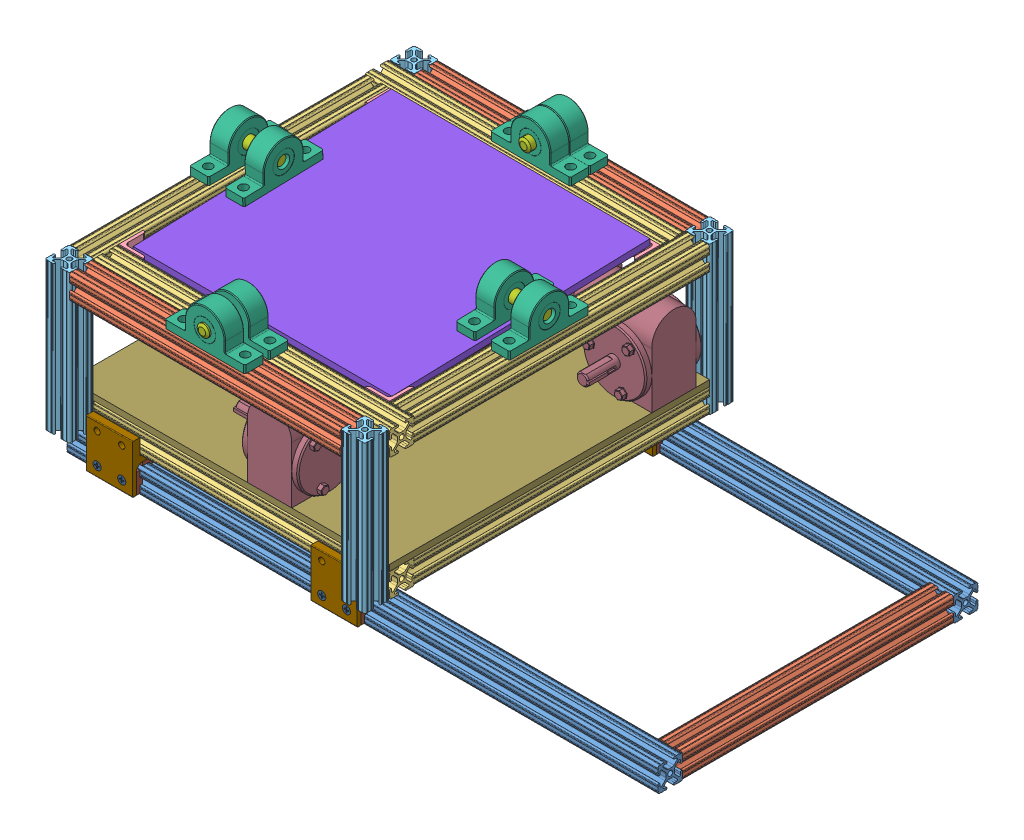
SolidWorks assembly Platform doneish.SLDASM, configuration Default (file format 9000). Lengths in mm.
Overall size (609.6 229.07 383.98).
87 component instances, 13 part files, 104 mates.
Components (placement in the parent):
- 24ftbar-1: 24ftbar.sldprt [Default] at (548.5997 314.1895 462.0163) x (0 0 -1) z (1 0 0) size (25.4 25.4 609.6)
- Beams11in-4: Beams11in.sldprt [Default] at (535.8997 314.1895 474.7163) size (25.4 25.4 279.4)
- Beams11in-5: Beams11in.sldprt [Default] at (-48.3003 314.1895 474.7163) size (25.4 25.4 279.4)
- 24ftbar-2: 24ftbar.sldprt [Default] at (548.5997 314.1895 157.2163) x (0 0 -1) z (1 0 0) size (25.4 25.4 609.6)
- Beams12in-4: Beams12in.sldprt [Default] at (271.7397 349.7495 462.1687) x (0 0 -1) z (1 0 0) size (25.4 25.4 304.8)
- Beams12in-5: Beams12in.sldprt [Default] at (259.0397 349.7495 144.6687) x (-1 0 0) z (0 0 -1) size (25.4 25.4 304.8)
- Beams12in-6: Beams12in.sldprt [Default] at (-45.7603 349.7495 170.0687) x (-1 0 0) z (0 0 -1) size (25.4 25.4 304.8)
- Beams12in-7: Beams12in.sldprt [Default] at (246.3397 349.7495 157.3687) x (0 0 -1) z (1 0 0) size (25.4 25.4 304.8)
- Corner bracket-1: Corner bracket.sldprt [Default] at (246.3397 349.7495 449.4687) x (0 -1 0) z (0 0 -1) size (25.4 25.4 25.4)
- Corner bracket-2: Corner bracket.sldprt [Default] at (-33.0603 349.7495 170.0687) x (0 1 0) z (1 0 0) size (25.4 25.4 25.4)
- Corner bracket-3: Corner bracket.sldprt [Default] at (246.3397 349.7495 170.0687) x (0 1 0) z (0 0 1) size (25.4 25.4 25.4)
- Corner bracket-4: Corner bracket.sldprt [Default] at (-33.0603 349.7495 449.4687) x (0 -1 0) z (1 0 0) size (25.4 25.4 25.4)
- Platform2-1: Platform2.SLDASM [Default] at (271.6705 476.3917 462.1369) x (0 0 -1) z (0.999998 -0.002168 0) size (330.2 25.4 330.2)
  - Beams12in-7: Beams12in.sldprt [Default] at origin size (25.4 25.4 304.8)
  - Beams12in-5: Beams12in.sldprt [Default] at (317.5 0 -12.7) x (0 0 -1) z (1 0 0) size (25.4 25.4 304.8)
  - Beams12in-6: Beams12in.sldprt [Default] at (292.1 0 -317.5) x (0 0 -1) z (1 0 0) size (25.4 25.4 304.8)
  - Beams12in-8: Beams12in.sldprt [Default] at (304.8 0 -25.4) size (25.4 25.4 304.8)
  - Corner bracket-1: Corner bracket.sldprt [Default] at (12.7 0 -25.4) x (0 -1 0) z (1 0 0) size (25.4 25.4 25.4)
  - Corner bracket-2: Corner bracket.sldprt [Default] at (292.1 0 -304.8) x (0 1 0) z (0 0 1) size (25.4 25.4 25.4)
  - Corner bracket-3: Corner bracket.sldprt [Default] at (292.1 0 -25.4) x (0 1 0) z (-1 0 0) size (25.4 25.4 25.4)
  - Corner bracket-4: Corner bracket.sldprt [Default] at (12.7 0 -304.8) x (0 -1 0) z (0 0 1) size (25.4 25.4 25.4)
- Beams6in-1: Beams6in.sldprt [Default] at (259.0397 184.6495 131.9687) x (0 0 -1) z (0 -1 0) size (25.4 25.4 152.4)
- Beams6in-2: Beams6in.sldprt [Default] at (259.0397 184.6495 487.5687) x (0 0 -1) z (0 -1 0) size (25.4 25.4 152.4)
- Sleeve bearing 05diameter-1: Sleeve bearing 05diameter.SLDPRT [2820T6] at (106.6397 508.4995 154.5588) x (-0.999998 0.002168 0) z (0 0 -1) size (82.55 39.69 19.84)
- Sleeve bearing 05diameter-2: Sleeve bearing 05diameter.SLDPRT [2820T6] at (106.6397 508.4995 464.915) x (0.999998 -0.002168 0) z (0 0 1) size (82.55 39.69 19.84)
- Beams6in-3: Beams6in.sldprt [Default] at (-45.7603 184.6495 131.9687) x (0 0 -1) z (0 -1 0) size (25.4 25.4 152.4)
- Beams6in-4: Beams6in.sldprt [Default] at (-45.7603 184.6495 487.5687) x (0 0 -1) z (0 -1 0) size (25.4 25.4 152.4)
- Beams11in-6: Beams11in.sldprt [Default] at (271.7397 476.7495 487.5687) x (0 0 -1) z (1 0 0) size (25.4 25.4 279.4)
- Beams11in-7: Beams11in.sldprt [Default] at (271.7397 476.7495 131.9687) x (0 0 -1) z (1 0 0) size (25.4 25.4 279.4)
- Sleeve bearing 05diameter-3: Sleeve bearing 05diameter.SLDPRT [2820T6] at (106.6397 508.4995 490.3468) x (-1 0 0) z (0 0 -1) size (82.55 39.69 19.84)
- Sleeve bearing 05diameter-4: Sleeve bearing 05diameter.SLDPRT [2820T6] at (106.6397 508.4995 134.7468) x (-1 0 0) z (0 0 -1) size (82.55 39.69 19.84)
- Rod-1: Rod.SLDPRT [Default] at (106.6397 508.4995 503.2532) x (0.451188 0.892429 0) z (0 0 -1) size (12.7 12.7 50.8)
- Rod-2: Rod.SLDPRT [Default] at (106.6397 508.4995 171.5164) x (-0.988826 0.149076 0) z (0 0 -1) size (12.7 12.7 50.8)
- Sleeve bearing 05diameter-5: Sleeve bearing 05diameter.SLDPRT [2820T6] at (261.8174 508.1631 309.7687) x (0 0 -1) z (0.999998 -0.002168 0) size (82.55 39.69 19.84)
- Sleeve bearing 05diameter-6: Sleeve bearing 05diameter.SLDPRT [2820T6] at (-48.5381 508.8359 309.7687) x (0 0 -1) z (0.999998 -0.002168 0) size (82.55 39.69 19.84)
- Sleeve bearing 05diameter-7: Sleeve bearing 05diameter.SLDPRT [2820T6] at (225.7813 508.2412 309.7687) x (0.000061 0.02798 -0.999608) z (0.999998 -0.002168 0) size (82.55 39.69 19.84)
- Sleeve bearing 05diameter-8: Sleeve bearing 05diameter.SLDPRT [2820T6] at (-12.5019 508.7577 309.7687) x (0.000061 0.02798 -0.999608) z (0.999998 -0.002168 0) size (82.55 39.69 19.84)
- Rod-3: Rod.SLDPRT [Default] at (218.3994 508.2572 309.7687) x (0.000846 0.390503 -0.920601) z (0.999998 -0.002168 0) size (12.7 12.7 50.8)
- Rod-4: Rod.SLDPRT [Default] at (-55.9199 508.8519 309.7687) x (-0.000416 -0.191908 -0.981413) z (0.999998 -0.002168 0) size (12.7 12.7 50.8)
- Plate-1: Plate.SLDPRT [Default] at (105.9719 483.1769 306.6951) x (-0.000727 0.027982 -0.999608) z (0.999997 -0.002146 -0.000787) size (266.7 6.35 266.7)
- Linearbearing-1: Linearbearing.sldasm [Default] at (222.5272 314.0371 462.1687) x (0 0 -1) z (1 0 0) size (41.25 49.99 47.63)
  - _6715_p_2-1: _6715_p_2.sldprt [Default] at origin size (41.25 49.99 47.63)
  - _3625__4-1: _3625__4.sldprt [Default] at (-18.973 0 12.6873) x (0 0 -1) z (0 -1 0) size (8.43 1.79 8.43)
  - _3625__4-2: _3625__4.sldprt [Default] at (-18.973 0 -12.7127) x (0 0 -1) z (0 -1 0) size (8.43 1.79 8.43)
  - _3625__4-3: _3625__4.sldprt [Default] at (18.973 0 12.6873) x (0 0 -1) z (0 1 0) size (8.43 1.79 8.43)
  - _3625__4-4: _3625__4.sldprt [Default] at (18.973 0 -12.7127) x (0 0 -1) z (0 1 0) size (8.43 1.79 8.43)
  - _3625__4-5: _3625__4.sldprt [Default] at (0 19.5826 12.6873) x (1 0 0) z (0 0 -1) size (8.43 1.79 8.43)
  - _3625__4-6: _3625__4.sldprt [Default] at (0 19.5826 -12.7127) x (1 0 0) z (0 0 -1) size (8.43 1.79 8.43)
  - _6790_11-1: _6790_11.sldprt [Default] at (-12.8524 0 -0.0254) x (0 0 -1) z (1 0 0) size (47.37 20.62 6.35)
  - _6790_11-2: _6790_11.sldprt [Default] at (12.8524 0 -0.0254) x (0 0 -1) z (-1 0 0) size (47.37 20.62 6.35)
  - _6790_11-3: _6790_11.sldprt [Default] at (0 12.8524 -0.0254) x (0 0 -1) z (0 -1 0) size (47.37 20.62 6.35)
- Linearbearing-2: Linearbearing.sldasm [Default] at (-9.2478 314.0371 462.1687) x (0 0 -1) z (1 0 0) size (41.25 49.99 47.63)
  - _6715_p_2-1: _6715_p_2.sldprt [Default] at origin size (41.25 49.99 47.63)
  - _3625__4-1: _3625__4.sldprt [Default] at (-18.973 0 12.6873) x (0 0 -1) z (0 -1 0) size (8.43 1.79 8.43)
  - _3625__4-2: _3625__4.sldprt [Default] at (-18.973 0 -12.7127) x (0 0 -1) z (0 -1 0) size (8.43 1.79 8.43)
  - _3625__4-3: _3625__4.sldprt [Default] at (18.973 0 12.6873) x (0 0 -1) z (0 1 0) size (8.43 1.79 8.43)
  - _3625__4-4: _3625__4.sldprt [Default] at (18.973 0 -12.7127) x (0 0 -1) z (0 1 0) size (8.43 1.79 8.43)
  - _3625__4-5: _3625__4.sldprt [Default] at (0 19.5826 12.6873) x (1 0 0) z (0 0 -1) size (8.43 1.79 8.43)
  - _3625__4-6: _3625__4.sldprt [Default] at (0 19.5826 -12.7127) x (1 0 0) z (0 0 -1) size (8.43 1.79 8.43)
  - _6790_11-1: _6790_11.sldprt [Default] at (-12.8524 0 -0.0254) x (0 0 -1) z (1 0 0) size (47.37 20.62 6.35)
  - _6790_11-2: _6790_11.sldprt [Default] at (12.8524 0 -0.0254) x (0 0 -1) z (-1 0 0) size (47.37 20.62 6.35)
  - _6790_11-3: _6790_11.sldprt [Default] at (0 12.8524 -0.0254) x (0 0 -1) z (0 -1 0) size (47.37 20.62 6.35)
- Linearbearing-3: Linearbearing.sldasm [Default] at (-9.2478 314.0371 157.3687) x (0 0 1) z (-1 0 0) size (41.25 49.99 47.63)
  - _6715_p_2-1: _6715_p_2.sldprt [Default] at origin size (41.25 49.99 47.63)
  - _3625__4-1: _3625__4.sldprt [Default] at (-18.973 0 12.6873) x (0 0 -1) z (0 -1 0) size (8.43 1.79 8.43)
  - _3625__4-2: _3625__4.sldprt [Default] at (-18.973 0 -12.7127) x (0 0 -1) z (0 -1 0) size (8.43 1.79 8.43)
  - _3625__4-3: _3625__4.sldprt [Default] at (18.973 0 12.6873) x (0 0 -1) z (0 1 0) size (8.43 1.79 8.43)
  - _3625__4-4: _3625__4.sldprt [Default] at (18.973 0 -12.7127) x (0 0 -1) z (0 1 0) size (8.43 1.79 8.43)
  - _3625__4-5: _3625__4.sldprt [Default] at (0 19.5826 12.6873) x (1 0 0) z (0 0 -1) size (8.43 1.79 8.43)
  - _3625__4-6: _3625__4.sldprt [Default] at (0 19.5826 -12.7127) x (1 0 0) z (0 0 -1) size (8.43 1.79 8.43)
  - _6790_11-1: _6790_11.sldprt [Default] at (-12.8524 0 -0.0254) x (0 0 -1) z (1 0 0) size (47.37 20.62 6.35)
  - _6790_11-2: _6790_11.sldprt [Default] at (12.8524 0 -0.0254) x (0 0 -1) z (-1 0 0) size (47.37 20.62 6.35)
  - _6790_11-3: _6790_11.sldprt [Default] at (0 12.8524 -0.0254) x (0 0 -1) z (0 -1 0) size (47.37 20.62 6.35)
- Linearbearing-4: Linearbearing.sldasm [Default] at (222.5272 314.0371 157.3687) x (0 0 1) z (-1 0 0) size (41.25 49.99 47.63)
  - _6715_p_2-1: _6715_p_2.sldprt [Default] at origin size (41.25 49.99 47.63)
  - _3625__4-1: _3625__4.sldprt [Default] at (-18.973 0 12.6873) x (0 0 -1) z (0 -1 0) size (8.43 1.79 8.43)
  - _3625__4-2: _3625__4.sldprt [Default] at (-18.973 0 -12.7127) x (0 0 -1) z (0 -1 0) size (8.43 1.79 8.43)
  - _3625__4-3: _3625__4.sldprt [Default] at (18.973 0 12.6873) x (0 0 -1) z (0 1 0) size (8.43 1.79 8.43)
  - _3625__4-4: _3625__4.sldprt [Default] at (18.973 0 -12.7127) x (0 0 -1) z (0 1 0) size (8.43 1.79 8.43)
  - _3625__4-5: _3625__4.sldprt [Default] at (0 19.5826 12.6873) x (1 0 0) z (0 0 -1) size (8.43 1.79 8.43)
  - _3625__4-6: _3625__4.sldprt [Default] at (0 19.5826 -12.7127) x (1 0 0) z (0 0 -1) size (8.43 1.79 8.43)
  - _6790_11-1: _6790_11.sldprt [Default] at (-12.8524 0 -0.0254) x (0 0 -1) z (1 0 0) size (47.37 20.62 6.35)
  - _6790_11-2: _6790_11.sldprt [Default] at (12.8524 0 -0.0254) x (0 0 -1) z (-1 0 0) size (47.37 20.62 6.35)
  - _6790_11-3: _6790_11.sldprt [Default] at (0 12.8524 -0.0254) x (0 0 -1) z (0 -1 0) size (47.37 20.62 6.35)
- bottom plate-1: bottom plate.SLDPRT [Default] at (106.6397 362.4495 309.7687) size (330.2 6.35 330.2)
- 59825K310_RIGHT-ANGLE SHAFT DC GEARMOTOR-1: 59825K310_RIGHT-ANGLE SHAFT DC GEARMOTOR.SLDPRT [59825K31] at (179.5377 427.2195 181.3098) size (223.17 90.17 100.08)
- 59825K310_RIGHT-ANGLE SHAFT DC GEARMOTOR-2: 59825K310_RIGHT-ANGLE SHAFT DC GEARMOTOR.SLDPRT [59825K31] at (148.0409 427.2195 382.6667) x (0 0 1) z (-1 0 0) size (223.17 90.17 100.08)
Mates (geometry in assembly coordinates):
- Coincident1: coincident anti-aligned: plane of 24ftbar-1 through (-61.0003 320.5226 449.3163) normal (0 0 -1); plane of Beams11in-4 through (535.8997 314.1895 449.3163) normal (0 0 1)
- Coincident3: coincident aligned: plane of 24ftbar-1 through (-61.0003 326.8895 452.4659) normal (0 1 0); plane of Beams11in-5 through (-54.6334 326.8895 169.9163) normal (0 1 0)
- Coincident5: coincident aligned: plane of 24ftbar-1 through (-61.0003 304.1311 474.7163) normal (-1 0 0); plane of Beams11in-5 through (-61.0003 307.8564 169.9163) normal (-1 0 0)
- Coincident6: coincident anti-aligned: plane of Beams11in-5 through (-61.0003 304.1311 169.9163) normal (0 0 -1); plane of 24ftbar-2 through (-61.0003 323.7399 169.9163) normal (0 0 1)
- Coincident7: coincident aligned: plane of Beams11in-5 through (-54.6334 326.8895 169.9163) normal (0 1 0); plane of 24ftbar-2 through (-61.0003 326.8895 163.5494) normal (0 1 0)
- Coincident8: coincident aligned: plane of Beams11in-5 through (-61.0003 307.8564 169.9163) normal (-1 0 0); plane of 24ftbar-2 through (-61.0003 304.1311 169.9163) normal (-1 0 0)
- Coincident9: coincident anti-aligned: plane of Beams11in-4 through (523.1997 304.1311 169.9163) normal (0 0 -1); plane of 24ftbar-2 through (-61.0003 323.7399 169.9163) normal (0 0 1)
- Coincident10: coincident aligned: plane of Beams11in-4 through (548.5997 304.6391 169.9163) normal (1 0 0); plane of 24ftbar-2 through (548.5997 304.1311 169.9163) normal (1 0 0)
- Coincident12: coincident aligned: plane of Beams11in-4 through (529.5666 326.8895 169.9163) normal (0 1 0); plane of 24ftbar-2 through (-61.0003 326.8895 147.6659) normal (0 1 0)
- Coincident13: coincident anti-aligned: plane of 24ftbar-1 through (-61.0003 320.5226 449.3163) normal (0 0 -1); plane of Linearbearing-2/_6790_11-2 through (-32.9587 317.2121 449.3163) normal (0 0 1)
- Coincident16: coincident anti-aligned: plane of 24ftbar-1 through (-61.0003 326.8895 468.3494) normal (0 1 0); plane of Linearbearing-2/_6790_11-3 through (-32.9587 326.8895 465.3437) normal (0 -1 0)
- Coincident17: coincident anti-aligned: plane of 24ftbar-1 through (-61.0003 304.6391 449.3163) normal (0 0 -1); plane of Linearbearing-1/_6790_11-2 through (198.8163 303.7247 449.3163) normal (0 0 1)
- Coincident18: coincident anti-aligned: plane of 24ftbar-1 through (-61.0003 326.8895 452.4659) normal (0 1 0); plane of Linearbearing-1/_6790_11-3 through (198.8163 326.8895 451.8563) normal (0 -1 0)
- Coincident19: coincident anti-aligned: plane of 24ftbar-2 through (-61.0003 320.5226 144.5163) normal (0 0 -1); plane of Linearbearing-4/_6790_11-1 through (246.2381 324.3495 144.5163) normal (0 0 1)
- Coincident20: coincident anti-aligned: plane of Linearbearing-4/_6790_11-3 through (246.2381 326.8895 167.6811) normal (0 -1 0); plane of 24ftbar-2 through (-61.0003 326.8895 163.5494) normal (0 1 0)
- Coincident21: coincident anti-aligned: plane of 24ftbar-2 through (-61.0003 320.5226 144.5163) normal (0 0 -1); plane of Linearbearing-3/_6790_11-1 through (14.4631 324.3495 144.5163) normal (0 0 1)
- Coincident22: coincident anti-aligned: plane of 24ftbar-2 through (-61.0003 326.8895 163.5494) normal (0 1 0); plane of Linearbearing-3/_6790_11-3 through (14.4631 326.8895 167.6811) normal (0 -1 0)
- LimitDistance1: limit distance = 2.54 mm anti-aligned: plane of Linearbearing-2/_6715_p_2-1 through (-33.0603 304.4867 482.0315) normal (-1 0 0); plane of Beams11in-5 through (-35.6003 320.5226 169.9163) normal (1 0 0)
- Coincident32: coincident anti-aligned: plane of bottom plate-1 through (106.6397 368.7995 309.7687) normal (0 1 0); plane of 59825K310_RIGHT-ANGLE SHAFT DC GEARMOTOR-1 through (271.7397 368.7995 204.1444) normal (0 -1 0)
- Coincident33: coincident anti-aligned: plane of bottom plate-1 through (106.6397 368.7995 309.7687) normal (0 1 0); plane of 59825K310_RIGHT-ANGLE SHAFT DC GEARMOTOR-2 through (125.2063 368.7995 474.8687) normal (0 -1 0)
- Coincident2: coincident anti-aligned: plane of Beams12in-4 through (-33.0603 356.0826 449.4687) normal (0 0 -1); plane of Corner bracket-1 through (246.3397 337.0495 449.4687) normal (0 0 1)
- Coincident34: coincident aligned: plane of Beams12in-4 through (-33.0603 362.4495 452.6183) normal (0 1 0); plane of Corner bracket-1 through (246.3397 362.4495 427.2437) normal (0 1 0)
- Coincident35: coincident anti-aligned: plane of Beams12in-4 through (-33.0603 356.0826 449.4687) normal (0 0 -1); plane of Beams12in-5 through (271.7397 339.6911 449.4687) normal (0 0 1)
- Coincident36: coincident aligned: plane of Beams12in-4 through (271.7397 339.6911 474.8687) normal (1 0 0); plane of Beams12in-5 through (271.7397 359.2999 449.4687) normal (1 0 0)
- Coincident37: coincident anti-aligned: plane of Beams12in-4 through (-33.0603 356.0826 449.4687) normal (0 0 -1); plane of Corner bracket-4 through (-7.6603 337.0495 449.4687) normal (0 0 1)
- Coincident38: coincident aligned: plane of Beams12in-4 through (-33.0603 362.4495 452.6183) normal (0 1 0); plane of Corner bracket-4 through (-10.8353 362.4495 449.4687) normal (0 1 0)
- Coincident40: coincident aligned: plane of Beams12in-4 through (-33.0603 337.0495 471.7191) normal (0 -1 0); plane of Beams6in-2 through (259.0397 337.0495 487.5687) normal (0 -1 0)
- Coincident41: coincident anti-aligned: plane of Beams12in-4 through (-33.0603 359.2999 474.8687) normal (0 0 1); plane of Beams6in-2 through (265.3728 489.4495 474.8687) normal (0 0 -1)
- Coincident45: coincident aligned: plane of Beams12in-4 through (271.7397 339.6911 474.8687) normal (1 0 0); plane of Beams6in-2 through (271.7397 489.4495 478.0183) normal (1 0 0)
- Coincident49: coincident anti-aligned: plane of Beams12in-4 through (-33.0603 359.2999 474.8687) normal (0 0 1); plane of Beams6in-4 through (-55.3107 489.4495 474.8687) normal (0 0 -1)
- Coincident4: coincident anti-aligned: plane of Beams12in-5 through (246.3397 356.0826 449.4687) normal (-1 0 0); plane of Corner bracket-1 through (246.3397 337.0495 424.0687) normal (1 0 0)
- Coincident50: coincident aligned: plane of Beams12in-5 through (249.4893 362.4495 449.4687) normal (0 1 0); plane of Corner bracket-1 through (246.3397 362.4495 427.2437) normal (0 1 0)
- Coincident51: coincident anti-aligned: plane of Beams12in-5 through (246.3397 356.0826 449.4687) normal (-1 0 0); plane of Beams12in-7 through (246.3397 339.6911 170.0687) normal (1 0 0)
- Coincident52: coincident aligned: plane of Beams12in-5 through (271.7397 339.6911 144.6687) normal (0 0 -1); plane of Beams12in-7 through (-58.4603 356.0826 144.6687) normal (0 0 -1)
- Coincident11: coincident aligned: plane of Beams12in-5 through (268.5901 337.0495 449.4687) normal (0 -1 0); plane of Beams12in-7 through (-58.4603 337.0495 151.0356) normal (0 -1 0)
- Coincident15: coincident anti-aligned: plane of Beams12in-5 through (246.3397 356.0826 449.4687) normal (-1 0 0); plane of Corner bracket-3 through (246.3397 362.4495 195.4687) normal (1 0 0)
- Coincident53: coincident aligned: plane of Beams12in-5 through (249.4893 362.4495 449.4687) normal (0 1 0); plane of Corner bracket-3 through (246.3397 362.4495 192.2937) normal (0 1 0)
- Coincident44: coincident aligned: plane of Beams12in-5 through (271.7397 343.4164 449.4687) normal (1 0 0); plane of Beams6in-1 through (271.7397 489.4495 138.3018) normal (1 0 0)
- Coincident54: coincident aligned: plane of Beams12in-6 through (-58.4603 356.0826 474.8687) normal (-1 0 0); plane of Beams12in-7 through (-58.4603 339.6911 170.0687) normal (-1 0 0)
- Coincident55: coincident anti-aligned: plane of Beams12in-6 through (-33.0603 339.6911 170.0687) normal (0 0 -1); plane of Beams12in-7 through (-58.4603 359.2999 170.0687) normal (0 0 1)
- Coincident56: coincident aligned: plane of Beams12in-6 through (-39.4272 362.4495 474.8687) normal (0 1 0); plane of Beams12in-7 through (-58.4603 362.4495 163.7018) normal (0 1 0)
- Coincident57: coincident anti-aligned: plane of Beams12in-6 through (-33.0603 359.2999 474.8687) normal (1 0 0); plane of Corner bracket-2 through (-33.0603 362.4495 170.0687) normal (-1 0 0)
- Coincident58: coincident anti-aligned: plane of Beams12in-6 through (-33.0603 359.2999 474.8687) normal (1 0 0); plane of Corner bracket-4 through (-33.0603 337.0495 449.4687) normal (-1 0 0)
- Coincident59: coincident aligned: plane of Beams12in-6 through (-58.4603 356.0826 474.8687) normal (-1 0 0); plane of Beams6in-4 through (-58.4603 489.4495 497.1191) normal (-1 0 0)
- Coincident60: coincident aligned: plane of Beams12in-6 through (-52.0934 337.0495 474.8687) normal (0 -1 0); plane of Beams6in-4 through (-45.7603 337.0495 487.5687) normal (0 -1 0)
- Coincident61: coincident anti-aligned: plane of Beams12in-7 through (-58.4603 359.2999 170.0687) normal (0 0 1); plane of Corner bracket-3 through (246.3397 362.4495 170.0687) normal (0 0 -1)
- Coincident62: coincident anti-aligned: plane of Beams12in-7 through (-58.4603 359.2999 170.0687) normal (0 0 1); plane of Corner bracket-2 through (-7.6603 362.4495 170.0687) normal (0 0 -1)
- Coincident63: coincident aligned: plane of Beams12in-7 through (-58.4603 362.4495 163.7018) normal (0 1 0); plane of Corner bracket-2 through (-10.8353 362.4495 170.0687) normal (0 1 0)
- Coincident42: coincident anti-aligned: plane of Beams12in-7 through (-58.4603 356.0826 144.6687) normal (0 0 -1); plane of Beams6in-1 through (268.5901 489.4495 144.6687) normal (0 0 1)
- Coincident43: coincident aligned: plane of Beams12in-7 through (-58.4603 337.0495 151.0356) normal (0 -1 0); plane of Beams6in-1 through (259.0397 337.0495 131.9687) normal (0 -1 0)
- Coincident46: coincident aligned: plane of Beams12in-7 through (-58.4603 339.6911 170.0687) normal (-1 0 0); plane of Beams6in-3 through (-58.4603 489.4495 125.6356) normal (-1 0 0)
- Coincident47: coincident anti-aligned: plane of Beams12in-7 through (-58.4603 356.0826 144.6687) normal (0 0 -1); plane of Beams6in-3 through (-52.0934 489.4495 144.6687) normal (0 0 1)
- Coincident48: coincident aligned: plane of Beams12in-7 through (-58.4603 337.0495 166.9191) normal (0 -1 0); plane of Beams6in-3 through (-45.7603 337.0495 131.9687) normal (0 -1 0)
- Coincident64: coincident aligned: plane of Platform2-1/Beams12in-8 through (-58.515 483.4405 144.6369) normal (0 0 -1); plane of Sleeve bearing 05diameter-1 through (106.6397 508.4995 144.6369) normal (0 0 -1)
- Coincident65: coincident anti-aligned: plane of Platform2-1/Beams12in-8 through (-58.5012 489.8074 163.67) normal (0.002168 0.999998 0); plane of Sleeve bearing 05diameter-1 through (147.8733 489.36 144.6369) normal (-0.002168 -0.999998 0)
- Coincident66: coincident aligned: plane of Platform2-1/Beams12in-7 through (-33.1081 486.6028 474.8369) normal (0 0 1); plane of Sleeve bearing 05diameter-2 through (106.6397 508.4995 474.8369) normal (0 0 1)
- Coincident39: coincident anti-aligned: plane of Platform2-1/Beams12in-7 through (-33.1013 489.7523 468.47) normal (0.002168 0.999998 0); plane of Sleeve bearing 05diameter-2 through (65.3235 489.539 474.8369) normal (-0.002168 -0.999998 0)
- Coincident67: coincident anti-aligned: plane of Platform2-1/Beams12in-5 through (249.4477 489.1399 449.4369) normal (0.002168 0.999998 0); plane of Sleeve bearing 05diameter-5 through (271.698 489.0916 351.0437) normal (-0.002168 -0.999998 0)
- Coincident68: coincident aligned: plane of Platform2-1/Beams12in-5 through (271.6912 485.942 449.4369) normal (0.999998 -0.002168 0); plane of Sleeve bearing 05diameter-5 through (271.7393 508.1416 309.7687) normal (0.999998 -0.002168 0)
- Coincident69: coincident anti-aligned: plane of Platform2-1/Beams12in-6 through (-55.3516 489.8006 474.8369) normal (0.002168 0.999998 0); plane of Sleeve bearing 05diameter-6 through (-38.6575 489.7644 351.0437) normal (-0.002168 -0.999998 0)
- Coincident70: coincident aligned: plane of Platform2-1/Beams12in-6 through (-58.515 483.4405 474.8369) normal (-0.999998 0.002168 0); plane of Sleeve bearing 05diameter-6 through (-58.4599 508.8574 309.7687) normal (-0.999998 0.002168 0)
- Lock5: lock: unknown of ?; unknown of Sleeve bearing 05diameter-2
- Lock6: lock: unknown of ?; unknown of Sleeve bearing 05diameter-1
- Coincident71: coincident aligned: plane of Beams6in-1 through (249.4893 489.4495 119.2687) normal (0 0 -1); plane of Beams11in-7 through (-33.0603 483.0826 119.2687) normal (0 0 -1)
- Coincident72: coincident anti-aligned: plane of Beams6in-1 through (246.3397 489.4495 125.6356) normal (-1 0 0); plane of Beams11in-7 through (246.3397 476.7495 131.9687) normal (1 0 0)
- Coincident73: coincident aligned: plane of Beams6in-1 through (248.9813 489.4495 144.6687) normal (0 1 0); plane of Beams11in-7 through (-33.0603 489.4495 138.3018) normal (0 1 0)
- Distance2: distance = 165.1 mm: plane of Beams6in-1 through (271.7397 489.4495 138.3018) normal (1 0 0); moEndPointRef_w of Rod-2
- Distance7: distance = 190.5 mm: moEndPointRef_w of Rod-3; plane of Beams6in-1 through (249.4893 489.4495 119.2687) normal (0 0 -1)
- Concentric5: concentric anti-aligned: cylinder of Sleeve bearing 05diameter-1 through (106.6397 508.4995 164.4807) axis (0 0 -1) radius 6.35; cylinder of Rod-2 through (106.6397 508.4995 120.7164) axis (0 0 1) radius 6.35
- Distance14: distance = 5.588 mm anti-aligned: plane of Sleeve bearing 05diameter-3 through (106.6397 508.4995 480.4249) normal (0 0 -1); plane of Sleeve bearing 05diameter-2 through (106.6397 508.4995 474.8369) normal (0 0 1)
- Distance8: distance = 190.5 mm: moEndPointRef_w of Rod-4; plane of Beams6in-3 through (-55.3107 489.4495 119.2687) normal (0 0 -1)
- Coincident74: coincident aligned: plane of Beams6in-4 through (-36.2099 489.4495 500.2687) normal (0 0 1); plane of Beams11in-6 through (-33.0603 486.2999 500.2687) normal (0 0 1)
- Coincident75: coincident aligned: plane of Beams6in-4 through (-55.8187 489.4495 500.2687) normal (0 1 0); plane of Beams11in-6 through (-33.0603 489.4495 478.0183) normal (0 1 0)
- Coincident76: coincident anti-aligned: plane of Beams6in-4 through (-33.0603 489.4495 493.9018) normal (1 0 0); plane of Beams11in-6 through (-33.0603 466.6911 500.2687) normal (-1 0 0)
- Coincident77: coincident aligned: plane of Beams11in-6 through (-33.0603 486.2999 500.2687) normal (0 0 1); plane of Sleeve bearing 05diameter-3 through (106.6397 508.4995 500.2687) normal (0 0 1)
- Coincident78: coincident anti-aligned: plane of Beams11in-6 through (-33.0603 489.4495 478.0183) normal (0 1 0); plane of Sleeve bearing 05diameter-3 through (147.9147 489.4495 480.4249) normal (0 -1 0)
- Lock2: lock: unknown of Beams11in-6; unknown of Sleeve bearing 05diameter-3
- Coincident79: coincident anti-aligned: plane of Beams11in-7 through (-33.0603 489.4495 122.4183) normal (0 1 0); plane of Sleeve bearing 05diameter-4 through (147.9147 489.4495 124.8249) normal (0 -1 0)
- Coincident80: coincident aligned: plane of Beams11in-7 through (-33.0603 486.2999 144.6687) normal (0 0 1); plane of Sleeve bearing 05diameter-4 through (106.6397 508.4995 144.6687) normal (0 0 1)
- Lock3: lock: unknown of Sleeve bearing 05diameter-3; unknown of Rod-1
- Concentric3: concentric anti-aligned: cylinder of Sleeve bearing 05diameter-4 through (106.6397 508.4995 144.6687) axis (0 0 -1) radius 6.35; cylinder of Rod-2 through (106.6397 508.4995 120.7164) axis (0 0 1) radius 6.35
- Concentric6: concentric anti-aligned: cylinder of Sleeve bearing 05diameter-5 through (251.8956 508.1846 309.7687) axis (0.999998 -0.002168 0) radius 6.35; cylinder of Rod-3 through (269.1993 508.1471 309.7687) axis (-0.999998 0.002168 0) radius 6.35
- Distance10: distance = 2.54 mm aligned: plane of Rod-3 through (269.1993 508.1471 309.7687) normal (0.999998 -0.002168 0); plane of Sleeve bearing 05diameter-5 through (271.7393 508.1416 309.7687) normal (0.999998 -0.002168 0)
- Concentric8: concentric aligned: cylinder of Sleeve bearing 05diameter-6 through (-58.4599 508.8574 309.7687) axis (0.999998 -0.002168 0) radius 6.35; cylinder of Sleeve bearing 05diameter-8 through (-22.4238 508.7792 309.7687) axis (0.999998 -0.002168 0) radius 6.35
- Concentric9: concentric anti-aligned: cylinder of Sleeve bearing 05diameter-6 through (-58.4599 508.8574 309.7687) axis (0.999998 -0.002168 0) radius 6.35; cylinder of Rod-4 through (-5.12 508.7417 309.7687) axis (-0.999998 0.002168 0) radius 6.35
- Distance13: distance = 2.54 mm aligned: plane of Rod-4 through (-55.9199 508.8519 309.7687) normal (-0.999998 0.002168 0); plane of Sleeve bearing 05diameter-6 through (-58.4599 508.8574 309.7687) normal (-0.999998 0.002168 0)
- Concentric7: concentric anti-aligned: cylinder of Sleeve bearing 05diameter-7 through (215.8594 508.2627 309.7687) axis (0.999998 -0.002168 0) radius 6.35; cylinder of Rod-3 through (269.1993 508.1471 309.7687) axis (-0.999998 0.002168 0) radius 6.35
- Distance11: distance = 2.54 mm aligned: plane of Rod-3 through (218.3994 508.2572 309.7687) normal (-0.999998 0.002168 0); plane of Sleeve bearing 05diameter-7 through (215.8594 508.2627 309.7687) normal (-0.999998 0.002168 0)
- Parallel3: parallel aligned: plane of Sleeve bearing 05diameter-7 through (235.6594 488.0223 350.4945) normal (-0.002167 -0.999606 -0.02798); plane of Plate-1 through (105.9719 483.1769 306.6951) normal (-0.002167 -0.999606 -0.02798)
- Concentric11: concentric anti-aligned: cylinder of Sleeve bearing 05diameter-8 through (-22.4238 508.7792 309.7687) axis (0.999998 -0.002168 0) radius 6.35; cylinder of Rod-4 through (-5.12 508.7417 309.7687) axis (-0.999998 0.002168 0) radius 6.35
- Distance12: distance = 2.54 mm aligned: plane of Rod-4 through (-5.12 508.7417 309.7687) normal (0.999998 -0.002168 0); plane of Sleeve bearing 05diameter-8 through (-2.5801 508.7362 309.7687) normal (0.999998 -0.002168 0)
- Coincident86: coincident anti-aligned: plane of Sleeve bearing 05diameter-8 through (-2.6238 488.5389 350.4945) normal (-0.002167 -0.999606 -0.02798); plane of Plate-1 through (105.9857 489.5244 306.8727) normal (0.002167 0.999606 0.02798)
- Lock1: lock: unknown of Sleeve bearing 05diameter-8; unknown of Plate-1
- Coincident87: coincident anti-aligned: plane of Beams12in-4 through (-33.0603 343.4164 474.8687) normal (0 0 1); plane of Linearbearing-2/_6715_p_2-1 through (14.5647 337.0495 474.8687) normal (0 0 -1)
- Tangent2: tangent anti-aligned: cylinder of Beams12in-4 through (-33.0603 339.1577 472.7605) axis (-1 0 0) radius 2.1082; plane of Linearbearing-2/_6715_p_2-1 through (14.5647 337.0495 442.3059) normal (0 1 0)
- Coincident88: coincident aligned: plane of Beams12in-4 through (-33.0603 359.2999 474.8687) normal (0 0 1); plane of bottom plate-1 through (271.7397 368.7995 474.8687) normal (0 0 1)
- Coincident89: coincident aligned: plane of Beams12in-5 through (271.7397 359.2999 449.4687) normal (1 0 0); plane of 59825K310_RIGHT-ANGLE SHAFT DC GEARMOTOR-1 through (271.7397 450.0795 181.3098) normal (1 0 0)
- Coincident90: coincident anti-aligned: plane of Beams12in-6 through (-55.3107 362.4495 474.8687) normal (0 1 0); plane of bottom plate-1 through (106.6397 362.4495 309.7687) normal (0 -1 0)
- Coincident91: coincident aligned: plane of Beams12in-6 through (-58.4603 356.0826 474.8687) normal (-1 0 0); plane of bottom plate-1 through (-58.4603 368.7995 474.8687) normal (-1 0 0)
- Coincident92: coincident anti-aligned: plane of Beams6in-1 through (246.3397 489.4495 141.5191) normal (-1 0 0); plane of Linearbearing-4/_6715_p_2-1 through (246.3397 304.4867 137.5059) normal (1 0 0)
- Coincident93: coincident anti-aligned: plane of Beams6in-2 through (246.3397 489.4495 497.1191) normal (-1 0 0); plane of Linearbearing-1/_6715_p_2-1 through (246.3397 304.4867 482.0315) normal (1 0 0)
- Coincident94: coincident anti-aligned: plane of Beams6in-3 through (-33.0603 489.4495 138.3018) normal (1 0 0); plane of Linearbearing-3/_6715_p_2-1 through (-33.0603 304.4867 137.5059) normal (-1 0 0)
- Coincident95: coincident anti-aligned: plane of Beams6in-4 through (-33.0603 489.4495 478.0183) normal (1 0 0); plane of Linearbearing-2/_6715_p_2-1 through (-33.0603 304.4867 482.0315) normal (-1 0 0)
- Coincident96: coincident aligned: plane of Beams12in-4 through (-33.0603 359.2999 474.8687) normal (0 0 1); plane of 59825K310_RIGHT-ANGLE SHAFT DC GEARMOTOR-2 through (148.0409 450.0795 474.8687) normal (0 0 1)
